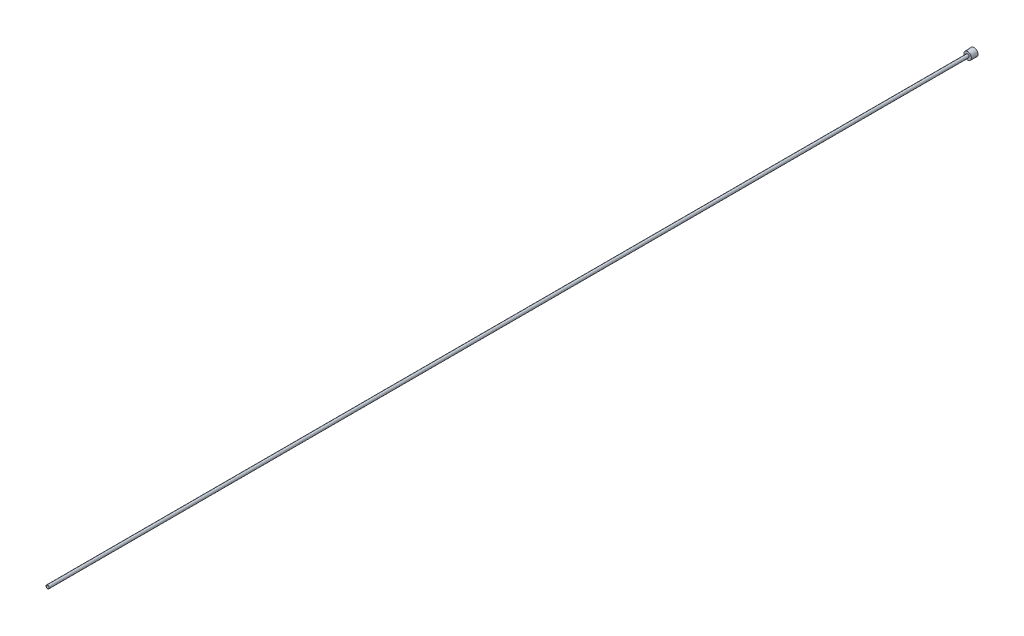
ISO-10303-21;
HEADER;
FILE_DESCRIPTION(('STEP AP214'),'2;1');
FILE_NAME('part.step','',(''),(''),'','','');
FILE_SCHEMA(('AUTOMOTIVE_DESIGN { 1 0 10303 214 1 1 1 1 }'));
ENDSEC;
DATA;
#1=APPLICATION_CONTEXT('core data for automotive mechanical design processes');
#2=APPLICATION_PROTOCOL_DEFINITION('international standard','automotive_design',2000,#1);
#3=PRODUCT_CONTEXT('',#1,'mechanical');
#4=PRODUCT('Part','Part','',(#3));
#5=PRODUCT_RELATED_PRODUCT_CATEGORY('part','',(#4));
#6=PRODUCT_DEFINITION_FORMATION('','',#4);
#7=PRODUCT_DEFINITION_CONTEXT('part definition',#1,'design');
#8=PRODUCT_DEFINITION('design','',#6,#7);
#9=PRODUCT_DEFINITION_SHAPE('','',#8);
#10=(LENGTH_UNIT() NAMED_UNIT(*) SI_UNIT(.MILLI.,.METRE.));
#11=(NAMED_UNIT(*) PLANE_ANGLE_UNIT() SI_UNIT($,.RADIAN.));
#12=(NAMED_UNIT(*) SI_UNIT($,.STERADIAN.) SOLID_ANGLE_UNIT());
#13=UNCERTAINTY_MEASURE_WITH_UNIT(LENGTH_MEASURE(1.E-05),#10,'distance_accuracy_value','');
#14=(GEOMETRIC_REPRESENTATION_CONTEXT(3) GLOBAL_UNCERTAINTY_ASSIGNED_CONTEXT((#13)) GLOBAL_UNIT_ASSIGNED_CONTEXT((#10,
#11,#12)) REPRESENTATION_CONTEXT('',''));
#15=CARTESIAN_POINT('',(0.,0.,0.));
#16=DIRECTION('',(0.,0.,1.));
#17=DIRECTION('',(1.,0.,0.));
#18=AXIS2_PLACEMENT_3D('',#15,#16,#17);
#19=CARTESIAN_POINT('',(0.,0.,0.));
#20=DIRECTION('',(0.,0.,1.));
#21=DIRECTION('',(1.,0.,0.));
#22=AXIS2_PLACEMENT_3D('',#19,#20,#21);
#23=CYLINDRICAL_SURFACE('',#22,1.3843);
#24=CARTESIAN_POINT('',(0.,0.,914.4));
#25=DIRECTION('',(0.,0.,1.));
#26=DIRECTION('',(1.,0.,0.));
#27=AXIS2_PLACEMENT_3D('',#24,#25,#26);
#28=CIRCLE('',#27,1.3843);
#29=CARTESIAN_POINT('',(1.3843,0.,914.4));
#30=VERTEX_POINT('',#29);
#31=EDGE_CURVE('E142',#30,#30,#28,.T.);
#32=ORIENTED_EDGE('',*,*,#31,.T.);
#33=EDGE_LOOP('',(#32));
#34=FACE_BOUND('',#33,.T.);
#35=CARTESIAN_POINT('',(0.,0.,3.96875));
#36=DIRECTION('',(0.,0.,-1.));
#37=DIRECTION('',(-1.,0.,0.));
#38=AXIS2_PLACEMENT_3D('',#35,#36,#37);
#39=CIRCLE('',#38,1.3843);
#40=CARTESIAN_POINT('',(-1.3843,0.,3.96875));
#41=VERTEX_POINT('',#40);
#42=EDGE_CURVE('E37',#41,#41,#39,.F.);
#43=ORIENTED_EDGE('',*,*,#42,.F.);
#44=EDGE_LOOP('',(#43));
#45=FACE_BOUND('',#44,.T.);
#46=ADVANCED_FACE('F33',(#34,#45),#23,.F.);
#47=CARTESIAN_POINT('',(0.,0.,0.));
#48=DIRECTION('',(0.,0.,1.));
#49=DIRECTION('',(1.,0.,0.));
#50=AXIS2_PLACEMENT_3D('',#47,#48,#49);
#51=PLANE('',#50);
#52=DIRECTION('',(-0.866025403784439,0.5,0.));
#53=VECTOR('',#52,1.);
#54=CARTESIAN_POINT('',(0.,-2.74963065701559,0.));
#55=LINE('',#54,#53);
#56=CARTESIAN_POINT('',(0.,-2.74963065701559,0.));
#57=VERTEX_POINT('',#56);
#58=CARTESIAN_POINT('',(-2.38125,-1.3748153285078,0.));
#59=VERTEX_POINT('',#58);
#60=EDGE_CURVE('E124',#57,#59,#55,.T.);
#61=ORIENTED_EDGE('',*,*,#60,.F.);
#62=DIRECTION('',(-0.866025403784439,-0.5,0.));
#63=VECTOR('',#62,1.);
#64=CARTESIAN_POINT('',(2.38125,-1.3748153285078,0.));
#65=LINE('',#64,#63);
#66=CARTESIAN_POINT('',(2.38125,-1.3748153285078,0.));
#67=VERTEX_POINT('',#66);
#68=EDGE_CURVE('E49',#67,#57,#65,.T.);
#69=ORIENTED_EDGE('',*,*,#68,.F.);
#70=DIRECTION('',(0.,-1.,0.));
#71=VECTOR('',#70,1.);
#72=CARTESIAN_POINT('',(2.38125,1.3748153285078,0.));
#73=LINE('',#72,#71);
#74=CARTESIAN_POINT('',(2.38125,1.3748153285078,0.));
#75=VERTEX_POINT('',#74);
#76=EDGE_CURVE('E133',#75,#67,#73,.T.);
#77=ORIENTED_EDGE('',*,*,#76,.F.);
#78=DIRECTION('',(0.866025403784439,-0.5,0.));
#79=VECTOR('',#78,1.);
#80=CARTESIAN_POINT('',(0.,2.74963065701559,0.));
#81=LINE('',#80,#79);
#82=CARTESIAN_POINT('',(0.,2.74963065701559,0.));
#83=VERTEX_POINT('',#82);
#84=EDGE_CURVE('E131',#83,#75,#81,.T.);
#85=ORIENTED_EDGE('',*,*,#84,.F.);
#86=DIRECTION('',(0.866025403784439,0.5,0.));
#87=VECTOR('',#86,1.);
#88=CARTESIAN_POINT('',(-2.38125,1.3748153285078,0.));
#89=LINE('',#88,#87);
#90=CARTESIAN_POINT('',(-2.38125,1.3748153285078,0.));
#91=VERTEX_POINT('',#90);
#92=EDGE_CURVE('E97',#91,#83,#89,.T.);
#93=ORIENTED_EDGE('',*,*,#92,.F.);
#94=DIRECTION('',(0.,1.,0.));
#95=VECTOR('',#94,1.);
#96=CARTESIAN_POINT('',(-2.38125,-1.3748153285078,0.));
#97=LINE('',#96,#95);
#98=EDGE_CURVE('E127',#59,#91,#97,.T.);
#99=ORIENTED_EDGE('',*,*,#98,.F.);
#100=EDGE_LOOP('',(#61,#69,#77,#85,#93,#99));
#101=FACE_BOUND('',#100,.T.);
#102=CARTESIAN_POINT('',(0.,0.,0.));
#103=DIRECTION('',(0.,0.,1.));
#104=DIRECTION('',(1.,0.,0.));
#105=AXIS2_PLACEMENT_3D('',#102,#103,#104);
#106=CIRCLE('',#105,3.8989);
#107=CARTESIAN_POINT('',(3.8989,0.,0.));
#108=VERTEX_POINT('',#107);
#109=EDGE_CURVE('E11',#108,#108,#106,.T.);
#110=ORIENTED_EDGE('',*,*,#109,.F.);
#111=EDGE_LOOP('',(#110));
#112=FACE_BOUND('',#111,.T.);
#113=ADVANCED_FACE('F35',(#101,#112),#51,.F.);
#114=CARTESIAN_POINT('',(0.,0.,0.));
#115=DIRECTION('',(0.,0.,-1.));
#116=DIRECTION('',(-1.,0.,0.));
#117=AXIS2_PLACEMENT_3D('',#114,#115,#116);
#118=CONICAL_SURFACE('',#117,3.8989,0.0364424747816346);
#119=CARTESIAN_POINT('',(0.,0.,6.35));
#120=DIRECTION('',(0.,0.,1.));
#121=DIRECTION('',(1.,0.,0.));
#122=AXIS2_PLACEMENT_3D('',#119,#120,#121);
#123=CIRCLE('',#122,3.66738778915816);
#124=CARTESIAN_POINT('',(3.66738778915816,0.,6.35));
#125=VERTEX_POINT('',#124);
#126=EDGE_CURVE('E42',#125,#125,#123,.T.);
#127=ORIENTED_EDGE('',*,*,#126,.F.);
#128=EDGE_LOOP('',(#127));
#129=FACE_BOUND('',#128,.T.);
#130=ORIENTED_EDGE('',*,*,#109,.T.);
#131=EDGE_LOOP('',(#130));
#132=FACE_BOUND('',#131,.T.);
#133=ADVANCED_FACE('F156',(#129,#132),#118,.T.);
#134=CARTESIAN_POINT('',(0.,3.66738778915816,6.35));
#135=DIRECTION('',(0.,0.,-1.));
#136=DIRECTION('',(-1.,0.,0.));
#137=AXIS2_PLACEMENT_3D('',#134,#135,#136);
#138=PLANE('',#137);
#139=CARTESIAN_POINT('',(0.,0.,6.35));
#140=DIRECTION('',(0.,0.,1.));
#141=DIRECTION('',(1.,0.,0.));
#142=AXIS2_PLACEMENT_3D('',#139,#140,#141);
#143=CIRCLE('',#142,1.5875);
#144=CARTESIAN_POINT('',(1.5875,0.,6.35));
#145=VERTEX_POINT('',#144);
#146=EDGE_CURVE('E148',#145,#145,#143,.T.);
#147=ORIENTED_EDGE('',*,*,#146,.F.);
#148=EDGE_LOOP('',(#147));
#149=FACE_BOUND('',#148,.T.);
#150=ORIENTED_EDGE('',*,*,#126,.T.);
#151=EDGE_LOOP('',(#150));
#152=FACE_BOUND('',#151,.T.);
#153=ADVANCED_FACE('F154',(#149,#152),#138,.F.);
#154=CARTESIAN_POINT('',(0.,0.,0.));
#155=DIRECTION('',(0.,0.,1.));
#156=DIRECTION('',(1.,0.,0.));
#157=AXIS2_PLACEMENT_3D('',#154,#155,#156);
#158=CYLINDRICAL_SURFACE('',#157,1.58749999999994);
#159=CARTESIAN_POINT('',(0.,0.,914.4));
#160=DIRECTION('',(0.,0.,1.));
#161=DIRECTION('',(1.,0.,0.));
#162=AXIS2_PLACEMENT_3D('',#159,#160,#161);
#163=CIRCLE('',#162,1.58749999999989);
#164=CARTESIAN_POINT('',(1.58749999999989,0.,914.4));
#165=VERTEX_POINT('',#164);
#166=EDGE_CURVE('E145',#165,#165,#163,.T.);
#167=ORIENTED_EDGE('',*,*,#166,.F.);
#168=EDGE_LOOP('',(#167));
#169=FACE_BOUND('',#168,.T.);
#170=ORIENTED_EDGE('',*,*,#146,.T.);
#171=EDGE_LOOP('',(#170));
#172=FACE_BOUND('',#171,.T.);
#173=ADVANCED_FACE('F190',(#169,#172),#158,.T.);
#174=CARTESIAN_POINT('',(0.,1.58749999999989,914.4));
#175=DIRECTION('',(0.,0.,-1.));
#176=DIRECTION('',(-1.,0.,0.));
#177=AXIS2_PLACEMENT_3D('',#174,#175,#176);
#178=PLANE('',#177);
#179=ORIENTED_EDGE('',*,*,#31,.F.);
#180=EDGE_LOOP('',(#179));
#181=FACE_BOUND('',#180,.T.);
#182=ORIENTED_EDGE('',*,*,#166,.T.);
#183=EDGE_LOOP('',(#182));
#184=FACE_BOUND('',#183,.T.);
#185=ADVANCED_FACE('F183',(#181,#184),#178,.F.);
#186=CARTESIAN_POINT('',(0.,-2.74963065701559,3.96875));
#187=DIRECTION('',(0.,0.,-1.));
#188=DIRECTION('',(-1.,0.,0.));
#189=AXIS2_PLACEMENT_3D('',#186,#187,#188);
#190=PLANE('',#189);
#191=DIRECTION('',(-0.866025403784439,-0.5,0.));
#192=VECTOR('',#191,1.);
#193=CARTESIAN_POINT('',(2.38125,-1.3748153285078,3.96875));
#194=LINE('',#193,#192);
#195=CARTESIAN_POINT('',(2.38125,-1.3748153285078,3.96875));
#196=VERTEX_POINT('',#195);
#197=CARTESIAN_POINT('',(0.,-2.74963065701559,3.96875));
#198=VERTEX_POINT('',#197);
#199=EDGE_CURVE('E135',#196,#198,#194,.T.);
#200=ORIENTED_EDGE('',*,*,#199,.T.);
#201=DIRECTION('',(-0.866025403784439,0.5,0.));
#202=VECTOR('',#201,1.);
#203=CARTESIAN_POINT('',(0.,-2.74963065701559,3.96875));
#204=LINE('',#203,#202);
#205=CARTESIAN_POINT('',(-2.38125,-1.3748153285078,3.96875));
#206=VERTEX_POINT('',#205);
#207=EDGE_CURVE('E118',#198,#206,#204,.T.);
#208=ORIENTED_EDGE('',*,*,#207,.T.);
#209=DIRECTION('',(0.,1.,0.));
#210=VECTOR('',#209,1.);
#211=CARTESIAN_POINT('',(-2.38125,-1.3748153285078,3.96875));
#212=LINE('',#211,#210);
#213=CARTESIAN_POINT('',(-2.38125,1.3748153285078,3.96875));
#214=VERTEX_POINT('',#213);
#215=EDGE_CURVE('E116',#206,#214,#212,.T.);
#216=ORIENTED_EDGE('',*,*,#215,.T.);
#217=DIRECTION('',(0.866025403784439,0.5,0.));
#218=VECTOR('',#217,1.);
#219=CARTESIAN_POINT('',(-2.38125,1.3748153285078,3.96875));
#220=LINE('',#219,#218);
#221=CARTESIAN_POINT('',(0.,2.74963065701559,3.96875));
#222=VERTEX_POINT('',#221);
#223=EDGE_CURVE('E94',#214,#222,#220,.T.);
#224=ORIENTED_EDGE('',*,*,#223,.T.);
#225=DIRECTION('',(0.866025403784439,-0.5,0.));
#226=VECTOR('',#225,1.);
#227=CARTESIAN_POINT('',(0.,2.74963065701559,3.96875));
#228=LINE('',#227,#226);
#229=CARTESIAN_POINT('',(2.38125,1.3748153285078,3.96875));
#230=VERTEX_POINT('',#229);
#231=EDGE_CURVE('E105',#222,#230,#228,.T.);
#232=ORIENTED_EDGE('',*,*,#231,.T.);
#233=DIRECTION('',(0.,-1.,0.));
#234=VECTOR('',#233,1.);
#235=CARTESIAN_POINT('',(2.38125,1.3748153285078,3.96875));
#236=LINE('',#235,#234);
#237=EDGE_CURVE('E109',#230,#196,#236,.T.);
#238=ORIENTED_EDGE('',*,*,#237,.T.);
#239=EDGE_LOOP('',(#200,#208,#216,#224,#232,#238));
#240=FACE_BOUND('',#239,.T.);
#241=ORIENTED_EDGE('',*,*,#42,.T.);
#242=EDGE_LOOP('',(#241));
#243=FACE_BOUND('',#242,.T.);
#244=ADVANCED_FACE('F112',(#240,#243),#190,.T.);
#245=CARTESIAN_POINT('',(2.38125,-1.3748153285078,3.96875));
#246=DIRECTION('',(0.5,-0.866025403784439,0.));
#247=DIRECTION('',(0.866025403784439,0.5,0.));
#248=AXIS2_PLACEMENT_3D('',#245,#246,#247);
#249=PLANE('',#248);
#250=ORIENTED_EDGE('',*,*,#68,.T.);
#251=DIRECTION('',(0.,0.,-1.));
#252=VECTOR('',#251,1.);
#253=CARTESIAN_POINT('',(0.,-2.74963065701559,3.96875));
#254=LINE('',#253,#252);
#255=EDGE_CURVE('E79',#198,#57,#254,.T.);
#256=ORIENTED_EDGE('',*,*,#255,.F.);
#257=ORIENTED_EDGE('',*,*,#199,.F.);
#258=DIRECTION('',(0.,0.,-1.));
#259=VECTOR('',#258,1.);
#260=CARTESIAN_POINT('',(2.38125,-1.3748153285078,3.96875));
#261=LINE('',#260,#259);
#262=EDGE_CURVE('E57',#196,#67,#261,.T.);
#263=ORIENTED_EDGE('',*,*,#262,.T.);
#264=EDGE_LOOP('',(#250,#256,#257,#263));
#265=FACE_BOUND('',#264,.T.);
#266=ADVANCED_FACE('F174',(#265),#249,.F.);
#267=CARTESIAN_POINT('',(2.38125,1.3748153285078,3.96875));
#268=DIRECTION('',(1.,0.,0.));
#269=DIRECTION('',(0.,0.,-1.));
#270=AXIS2_PLACEMENT_3D('',#267,#268,#269);
#271=PLANE('',#270);
#272=ORIENTED_EDGE('',*,*,#76,.T.);
#273=ORIENTED_EDGE('',*,*,#262,.F.);
#274=ORIENTED_EDGE('',*,*,#237,.F.);
#275=DIRECTION('',(0.,0.,-1.));
#276=VECTOR('',#275,1.);
#277=CARTESIAN_POINT('',(2.38125,1.3748153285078,3.96875));
#278=LINE('',#277,#276);
#279=EDGE_CURVE('E101',#230,#75,#278,.T.);
#280=ORIENTED_EDGE('',*,*,#279,.T.);
#281=EDGE_LOOP('',(#272,#273,#274,#280));
#282=FACE_BOUND('',#281,.T.);
#283=ADVANCED_FACE('F176',(#282),#271,.F.);
#284=CARTESIAN_POINT('',(0.,2.74963065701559,3.96875));
#285=DIRECTION('',(0.5,0.866025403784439,0.));
#286=DIRECTION('',(-0.866025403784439,0.5,0.));
#287=AXIS2_PLACEMENT_3D('',#284,#285,#286);
#288=PLANE('',#287);
#289=ORIENTED_EDGE('',*,*,#84,.T.);
#290=ORIENTED_EDGE('',*,*,#279,.F.);
#291=ORIENTED_EDGE('',*,*,#231,.F.);
#292=DIRECTION('',(0.,0.,-1.));
#293=VECTOR('',#292,1.);
#294=CARTESIAN_POINT('',(0.,2.74963065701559,3.96875));
#295=LINE('',#294,#293);
#296=EDGE_CURVE('E90',#222,#83,#295,.T.);
#297=ORIENTED_EDGE('',*,*,#296,.T.);
#298=EDGE_LOOP('',(#289,#290,#291,#297));
#299=FACE_BOUND('',#298,.T.);
#300=ADVANCED_FACE('F106',(#299),#288,.F.);
#301=CARTESIAN_POINT('',(-2.38125,1.3748153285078,3.96875));
#302=DIRECTION('',(-0.5,0.866025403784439,0.));
#303=DIRECTION('',(-0.866025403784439,-0.5,0.));
#304=AXIS2_PLACEMENT_3D('',#301,#302,#303);
#305=PLANE('',#304);
#306=ORIENTED_EDGE('',*,*,#92,.T.);
#307=ORIENTED_EDGE('',*,*,#296,.F.);
#308=ORIENTED_EDGE('',*,*,#223,.F.);
#309=DIRECTION('',(0.,0.,-1.));
#310=VECTOR('',#309,1.);
#311=CARTESIAN_POINT('',(-2.38125,1.3748153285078,3.96875));
#312=LINE('',#311,#310);
#313=EDGE_CURVE('E102',#214,#91,#312,.T.);
#314=ORIENTED_EDGE('',*,*,#313,.T.);
#315=EDGE_LOOP('',(#306,#307,#308,#314));
#316=FACE_BOUND('',#315,.T.);
#317=ADVANCED_FACE('F92',(#316),#305,.F.);
#318=CARTESIAN_POINT('',(-2.38125,-1.3748153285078,3.96875));
#319=DIRECTION('',(-1.,0.,0.));
#320=DIRECTION('',(0.,-1.,0.));
#321=AXIS2_PLACEMENT_3D('',#318,#319,#320);
#322=PLANE('',#321);
#323=ORIENTED_EDGE('',*,*,#98,.T.);
#324=ORIENTED_EDGE('',*,*,#313,.F.);
#325=ORIENTED_EDGE('',*,*,#215,.F.);
#326=DIRECTION('',(0.,0.,-1.));
#327=VECTOR('',#326,1.);
#328=CARTESIAN_POINT('',(-2.38125,-1.3748153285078,3.96875));
#329=LINE('',#328,#327);
#330=EDGE_CURVE('E139',#206,#59,#329,.T.);
#331=ORIENTED_EDGE('',*,*,#330,.T.);
#332=EDGE_LOOP('',(#323,#324,#325,#331));
#333=FACE_BOUND('',#332,.T.);
#334=ADVANCED_FACE('F246',(#333),#322,.F.);
#335=CARTESIAN_POINT('',(0.,-2.74963065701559,3.96875));
#336=DIRECTION('',(-0.5,-0.866025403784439,0.));
#337=DIRECTION('',(0.866025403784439,-0.5,0.));
#338=AXIS2_PLACEMENT_3D('',#335,#336,#337);
#339=PLANE('',#338);
#340=ORIENTED_EDGE('',*,*,#60,.T.);
#341=ORIENTED_EDGE('',*,*,#330,.F.);
#342=ORIENTED_EDGE('',*,*,#207,.F.);
#343=ORIENTED_EDGE('',*,*,#255,.T.);
#344=EDGE_LOOP('',(#340,#341,#342,#343));
#345=FACE_BOUND('',#344,.T.);
#346=ADVANCED_FACE('F172',(#345),#339,.F.);
#347=CLOSED_SHELL('',(#46,#113,#133,#153,#173,#185,#244,#266,#283,#300,#317,#334,#346));
#348=MANIFOLD_SOLID_BREP('B2',#347);
#349=ADVANCED_BREP_SHAPE_REPRESENTATION('',(#18,#348),#14);
#350=SHAPE_DEFINITION_REPRESENTATION(#9,#349);
ENDSEC;
END-ISO-10303-21;
